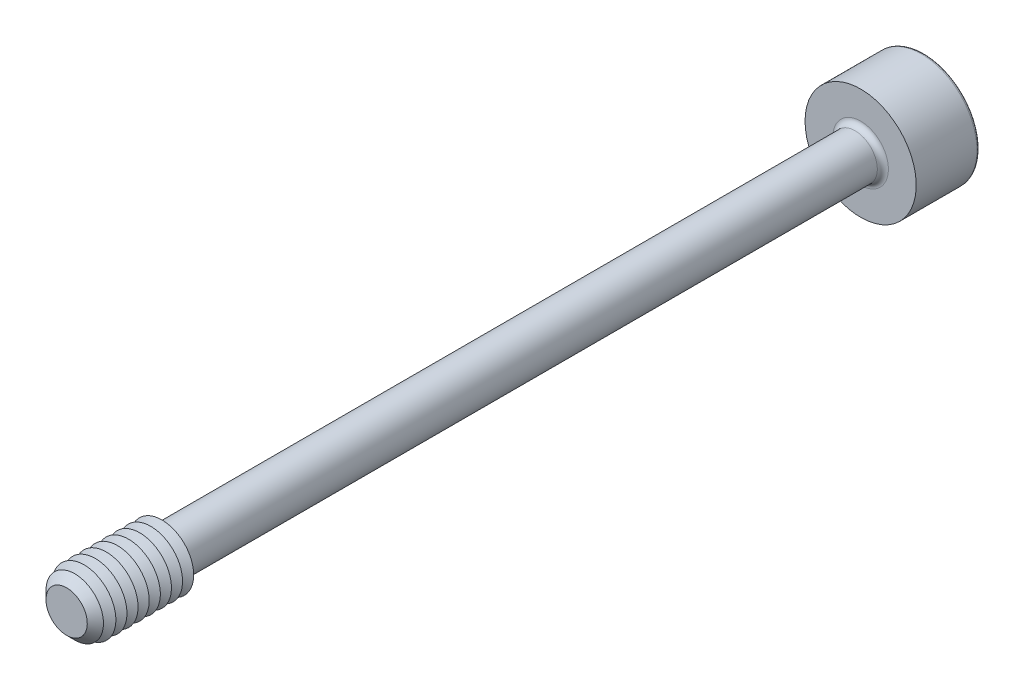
ISO-10303-21;
HEADER;
FILE_DESCRIPTION(('STEP AP214'),'2;1');
FILE_NAME('part.step','',(''),(''),'','','');
FILE_SCHEMA(('AUTOMOTIVE_DESIGN { 1 0 10303 214 1 1 1 1 }'));
ENDSEC;
DATA;
#1=APPLICATION_CONTEXT('core data for automotive mechanical design processes');
#2=APPLICATION_PROTOCOL_DEFINITION('international standard','automotive_design',2000,#1);
#3=PRODUCT_CONTEXT('',#1,'mechanical');
#4=PRODUCT('Part','Part','',(#3));
#5=PRODUCT_RELATED_PRODUCT_CATEGORY('part','',(#4));
#6=PRODUCT_DEFINITION_FORMATION('','',#4);
#7=PRODUCT_DEFINITION_CONTEXT('part definition',#1,'design');
#8=PRODUCT_DEFINITION('design','',#6,#7);
#9=PRODUCT_DEFINITION_SHAPE('','',#8);
#10=(LENGTH_UNIT() NAMED_UNIT(*) SI_UNIT(.MILLI.,.METRE.));
#11=(NAMED_UNIT(*) PLANE_ANGLE_UNIT() SI_UNIT($,.RADIAN.));
#12=(NAMED_UNIT(*) SI_UNIT($,.STERADIAN.) SOLID_ANGLE_UNIT());
#13=UNCERTAINTY_MEASURE_WITH_UNIT(LENGTH_MEASURE(1.E-05),#10,'distance_accuracy_value','');
#14=(GEOMETRIC_REPRESENTATION_CONTEXT(3) GLOBAL_UNCERTAINTY_ASSIGNED_CONTEXT((#13)) GLOBAL_UNIT_ASSIGNED_CONTEXT((#10,
#11,#12)) REPRESENTATION_CONTEXT('',''));
#15=CARTESIAN_POINT('',(0.,0.,0.));
#16=DIRECTION('',(0.,0.,1.));
#17=DIRECTION('',(1.,0.,0.));
#18=AXIS2_PLACEMENT_3D('',#15,#16,#17);
#19=CARTESIAN_POINT('',(-0.866025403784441,-1.5,-26.));
#20=DIRECTION('',(0.,0.,1.));
#21=DIRECTION('',(1.,0.,0.));
#22=AXIS2_PLACEMENT_3D('',#19,#20,#21);
#23=PLANE('',#22);
#24=DIRECTION('',(1.,0.,0.));
#25=VECTOR('',#24,1.);
#26=CARTESIAN_POINT('',(-0.866025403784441,-1.5,-26.));
#27=LINE('',#26,#25);
#28=CARTESIAN_POINT('',(0.,-1.5,-26.));
#29=VERTEX_POINT('',#28);
#30=CARTESIAN_POINT('',(0.866025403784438,-1.5,-26.));
#31=VERTEX_POINT('',#30);
#32=EDGE_CURVE('E761',#29,#31,#27,.T.);
#33=ORIENTED_EDGE('',*,*,#32,.F.);
#34=CARTESIAN_POINT('',(0.,0.,-26.));
#35=DIRECTION('',(0.,0.,1.));
#36=DIRECTION('',(0.,-1.,0.));
#37=AXIS2_PLACEMENT_3D('',#34,#35,#36);
#38=CIRCLE('',#37,1.5);
#39=CARTESIAN_POINT('',(1.29903810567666,-0.75,-26.));
#40=VERTEX_POINT('',#39);
#41=EDGE_CURVE('E53',#29,#40,#38,.T.);
#42=ORIENTED_EDGE('',*,*,#41,.T.);
#43=DIRECTION('',(0.5,0.866025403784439,0.));
#44=VECTOR('',#43,1.);
#45=CARTESIAN_POINT('',(0.866025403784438,-1.5,-26.));
#46=LINE('',#45,#44);
#47=EDGE_CURVE('E746',#31,#40,#46,.T.);
#48=ORIENTED_EDGE('',*,*,#47,.F.);
#49=EDGE_LOOP('',(#33,#42,#48));
#50=FACE_BOUND('',#49,.T.);
#51=ADVANCED_FACE('F41',(#50),#23,.F.);
#52=CARTESIAN_POINT('',(1.73205080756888,0.,-26.));
#53=VERTEX_POINT('',#52);
#54=EDGE_CURVE('E757',#40,#53,#46,.T.);
#55=ORIENTED_EDGE('',*,*,#54,.F.);
#56=CARTESIAN_POINT('',(1.29903810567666,0.749999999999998,-26.));
#57=VERTEX_POINT('',#56);
#58=EDGE_CURVE('E11',#40,#57,#38,.T.);
#59=ORIENTED_EDGE('',*,*,#58,.T.);
#60=DIRECTION('',(-0.5,0.866025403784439,0.));
#61=VECTOR('',#60,1.);
#62=CARTESIAN_POINT('',(1.73205080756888,0.,-26.));
#63=LINE('',#62,#61);
#64=EDGE_CURVE('E745',#53,#57,#63,.T.);
#65=ORIENTED_EDGE('',*,*,#64,.F.);
#66=EDGE_LOOP('',(#55,#59,#65));
#67=FACE_BOUND('',#66,.T.);
#68=ADVANCED_FACE('F133',(#67),#23,.F.);
#69=CARTESIAN_POINT('',(0.866025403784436,1.5,-26.));
#70=VERTEX_POINT('',#69);
#71=EDGE_CURVE('E740',#57,#70,#63,.T.);
#72=ORIENTED_EDGE('',*,*,#71,.F.);
#73=CARTESIAN_POINT('',(0.,1.5,-26.));
#74=VERTEX_POINT('',#73);
#75=EDGE_CURVE('E51',#57,#74,#38,.T.);
#76=ORIENTED_EDGE('',*,*,#75,.T.);
#77=DIRECTION('',(-1.,0.,0.));
#78=VECTOR('',#77,1.);
#79=CARTESIAN_POINT('',(0.866025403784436,1.5,-26.));
#80=LINE('',#79,#78);
#81=EDGE_CURVE('E177',#70,#74,#80,.T.);
#82=ORIENTED_EDGE('',*,*,#81,.F.);
#83=EDGE_LOOP('',(#72,#76,#82));
#84=FACE_BOUND('',#83,.T.);
#85=ADVANCED_FACE('F139',(#84),#23,.F.);
#86=CARTESIAN_POINT('',(-0.866025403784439,1.5,-26.));
#87=VERTEX_POINT('',#86);
#88=EDGE_CURVE('E751',#74,#87,#80,.T.);
#89=ORIENTED_EDGE('',*,*,#88,.F.);
#90=CARTESIAN_POINT('',(-1.29903810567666,0.749999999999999,-26.));
#91=VERTEX_POINT('',#90);
#92=EDGE_CURVE('E265',#74,#91,#38,.T.);
#93=ORIENTED_EDGE('',*,*,#92,.T.);
#94=DIRECTION('',(-0.5,-0.866025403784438,0.));
#95=VECTOR('',#94,1.);
#96=CARTESIAN_POINT('',(-0.866025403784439,1.5,-26.));
#97=LINE('',#96,#95);
#98=EDGE_CURVE('E176',#87,#91,#97,.T.);
#99=ORIENTED_EDGE('',*,*,#98,.F.);
#100=EDGE_LOOP('',(#89,#93,#99));
#101=FACE_BOUND('',#100,.T.);
#102=ADVANCED_FACE('F157',(#101),#23,.F.);
#103=CARTESIAN_POINT('',(-1.73205080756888,0.,-26.));
#104=VERTEX_POINT('',#103);
#105=EDGE_CURVE('E170',#91,#104,#97,.T.);
#106=ORIENTED_EDGE('',*,*,#105,.F.);
#107=CARTESIAN_POINT('',(-1.29903810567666,-0.749999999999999,-26.));
#108=VERTEX_POINT('',#107);
#109=EDGE_CURVE('E172',#91,#108,#38,.T.);
#110=ORIENTED_EDGE('',*,*,#109,.T.);
#111=DIRECTION('',(0.5,-0.866025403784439,0.));
#112=VECTOR('',#111,1.);
#113=CARTESIAN_POINT('',(-1.73205080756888,0.,-26.));
#114=LINE('',#113,#112);
#115=EDGE_CURVE('E174',#104,#108,#114,.T.);
#116=ORIENTED_EDGE('',*,*,#115,.F.);
#117=EDGE_LOOP('',(#106,#110,#116));
#118=FACE_BOUND('',#117,.T.);
#119=ADVANCED_FACE('F146',(#118),#23,.F.);
#120=CARTESIAN_POINT('',(0.,0.,-29.));
#121=DIRECTION('',(0.,0.,-1.));
#122=DIRECTION('',(-1.,0.,0.));
#123=AXIS2_PLACEMENT_3D('',#120,#121,#122);
#124=PLANE('',#123);
#125=CARTESIAN_POINT('',(0.,0.,-29.));
#126=DIRECTION('',(0.,0.,-1.));
#127=DIRECTION('',(-1.,0.,0.));
#128=AXIS2_PLACEMENT_3D('',#125,#126,#127);
#129=CIRCLE('',#128,3.325);
#130=CARTESIAN_POINT('',(-3.325,0.,-29.));
#131=VERTEX_POINT('',#130);
#132=EDGE_CURVE('E251',#131,#131,#129,.T.);
#133=ORIENTED_EDGE('',*,*,#132,.T.);
#134=EDGE_LOOP('',(#133));
#135=FACE_BOUND('',#134,.T.);
#136=DIRECTION('',(-0.5,-0.866025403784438,0.));
#137=VECTOR('',#136,1.);
#138=CARTESIAN_POINT('',(-0.866025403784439,1.5,-29.));
#139=LINE('',#138,#137);
#140=CARTESIAN_POINT('',(-0.866025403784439,1.5,-29.));
#141=VERTEX_POINT('',#140);
#142=CARTESIAN_POINT('',(-1.73205080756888,0.,-29.));
#143=VERTEX_POINT('',#142);
#144=EDGE_CURVE('E212',#141,#143,#139,.T.);
#145=ORIENTED_EDGE('',*,*,#144,.T.);
#146=DIRECTION('',(0.5,-0.866025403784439,0.));
#147=VECTOR('',#146,1.);
#148=CARTESIAN_POINT('',(-1.73205080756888,0.,-29.));
#149=LINE('',#148,#147);
#150=CARTESIAN_POINT('',(-0.866025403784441,-1.5,-29.));
#151=VERTEX_POINT('',#150);
#152=EDGE_CURVE('E67',#143,#151,#149,.T.);
#153=ORIENTED_EDGE('',*,*,#152,.T.);
#154=DIRECTION('',(1.,0.,0.));
#155=VECTOR('',#154,1.);
#156=CARTESIAN_POINT('',(-0.866025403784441,-1.5,-29.));
#157=LINE('',#156,#155);
#158=CARTESIAN_POINT('',(0.866025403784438,-1.5,-29.));
#159=VERTEX_POINT('',#158);
#160=EDGE_CURVE('E196',#151,#159,#157,.T.);
#161=ORIENTED_EDGE('',*,*,#160,.T.);
#162=DIRECTION('',(0.5,0.866025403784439,0.));
#163=VECTOR('',#162,1.);
#164=CARTESIAN_POINT('',(0.866025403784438,-1.5,-29.));
#165=LINE('',#164,#163);
#166=CARTESIAN_POINT('',(1.73205080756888,0.,-29.));
#167=VERTEX_POINT('',#166);
#168=EDGE_CURVE('E200',#159,#167,#165,.T.);
#169=ORIENTED_EDGE('',*,*,#168,.T.);
#170=DIRECTION('',(-0.5,0.866025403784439,0.));
#171=VECTOR('',#170,1.);
#172=CARTESIAN_POINT('',(1.73205080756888,0.,-29.));
#173=LINE('',#172,#171);
#174=CARTESIAN_POINT('',(0.866025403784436,1.5,-29.));
#175=VERTEX_POINT('',#174);
#176=EDGE_CURVE('E204',#167,#175,#173,.T.);
#177=ORIENTED_EDGE('',*,*,#176,.T.);
#178=DIRECTION('',(-1.,0.,0.));
#179=VECTOR('',#178,1.);
#180=CARTESIAN_POINT('',(0.866025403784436,1.5,-29.));
#181=LINE('',#180,#179);
#182=EDGE_CURVE('E208',#175,#141,#181,.T.);
#183=ORIENTED_EDGE('',*,*,#182,.T.);
#184=EDGE_LOOP('',(#145,#153,#161,#169,#177,#183));
#185=FACE_BOUND('',#184,.T.);
#186=ADVANCED_FACE('F156',(#135,#185),#124,.T.);
#187=CARTESIAN_POINT('',(0.,0.,25.));
#188=DIRECTION('',(0.,0.,-1.));
#189=DIRECTION('',(-1.,0.,0.));
#190=AXIS2_PLACEMENT_3D('',#187,#188,#189);
#191=CYLINDRICAL_SURFACE('',#190,1.4);
#192=CARTESIAN_POINT('',(0.,0.,-24.65));
#193=DIRECTION('',(0.,0.,-1.));
#194=DIRECTION('',(-1.,0.,0.));
#195=AXIS2_PLACEMENT_3D('',#192,#193,#194);
#196=CIRCLE('',#195,1.4);
#197=CARTESIAN_POINT('',(-1.4,0.,-24.65));
#198=VERTEX_POINT('',#197);
#199=EDGE_CURVE('E247',#198,#198,#196,.F.);
#200=ORIENTED_EDGE('',*,*,#199,.T.);
#201=EDGE_LOOP('',(#200));
#202=FACE_BOUND('',#201,.T.);
#203=CARTESIAN_POINT('',(0.,0.,18.6535898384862));
#204=DIRECTION('',(0.,0.,-1.));
#205=DIRECTION('',(0.,1.,0.));
#206=AXIS2_PLACEMENT_3D('',#203,#204,#205);
#207=CIRCLE('',#206,1.4);
#208=CARTESIAN_POINT('',(0.,1.4,18.6535898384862));
#209=VERTEX_POINT('',#208);
#210=EDGE_CURVE('E235',#209,#209,#207,.T.);
#211=ORIENTED_EDGE('',*,*,#210,.T.);
#212=EDGE_LOOP('',(#211));
#213=FACE_BOUND('',#212,.T.);
#214=ADVANCED_FACE('F163',(#202,#213),#191,.T.);
#215=CARTESIAN_POINT('',(0.,0.,18.6535898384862));
#216=DIRECTION('',(0.,0.,1.));
#217=DIRECTION('',(0.,-1.,0.));
#218=AXIS2_PLACEMENT_3D('',#215,#216,#217);
#219=CONICAL_SURFACE('',#218,1.4,1.04719755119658);
#220=CARTESIAN_POINT('',(0.,0.,19.));
#221=DIRECTION('',(0.,0.,-1.));
#222=DIRECTION('',(-1.,0.,0.));
#223=AXIS2_PLACEMENT_3D('',#220,#221,#222);
#224=CIRCLE('',#223,2.);
#225=CARTESIAN_POINT('',(-2.,0.,19.));
#226=VERTEX_POINT('',#225);
#227=EDGE_CURVE('E269',#226,#226,#224,.T.);
#228=ORIENTED_EDGE('',*,*,#227,.T.);
#229=EDGE_LOOP('',(#228));
#230=FACE_BOUND('',#229,.T.);
#231=ORIENTED_EDGE('',*,*,#210,.F.);
#232=EDGE_LOOP('',(#231));
#233=FACE_BOUND('',#232,.T.);
#234=ADVANCED_FACE('F509',(#230,#233),#219,.T.);
#235=CARTESIAN_POINT('',(0.,0.,-25.));
#236=DIRECTION('',(0.,0.,-1.));
#237=DIRECTION('',(-1.,0.,0.));
#238=AXIS2_PLACEMENT_3D('',#235,#236,#237);
#239=PLANE('',#238);
#240=CARTESIAN_POINT('',(0.,0.,-25.));
#241=DIRECTION('',(0.,0.,-1.));
#242=DIRECTION('',(-1.,0.,0.));
#243=AXIS2_PLACEMENT_3D('',#240,#241,#242);
#244=CIRCLE('',#243,1.75);
#245=CARTESIAN_POINT('',(-1.75,0.,-25.));
#246=VERTEX_POINT('',#245);
#247=EDGE_CURVE('E243',#246,#246,#244,.T.);
#248=ORIENTED_EDGE('',*,*,#247,.T.);
#249=EDGE_LOOP('',(#248));
#250=FACE_BOUND('',#249,.T.);
#251=CARTESIAN_POINT('',(0.,0.,-25.));
#252=DIRECTION('',(0.,0.,-1.));
#253=DIRECTION('',(-1.,0.,0.));
#254=AXIS2_PLACEMENT_3D('',#251,#252,#253);
#255=CIRCLE('',#254,3.5);
#256=CARTESIAN_POINT('',(-3.5,0.,-25.));
#257=VERTEX_POINT('',#256);
#258=EDGE_CURVE('E231',#257,#257,#255,.T.);
#259=ORIENTED_EDGE('',*,*,#258,.F.);
#260=EDGE_LOOP('',(#259));
#261=FACE_BOUND('',#260,.T.);
#262=ADVANCED_FACE('F502',(#250,#261),#239,.F.);
#263=CARTESIAN_POINT('',(0.,0.,-29.));
#264=DIRECTION('',(0.,0.,1.));
#265=DIRECTION('',(1.,0.,0.));
#266=AXIS2_PLACEMENT_3D('',#263,#264,#265);
#267=CYLINDRICAL_SURFACE('',#266,3.5);
#268=CARTESIAN_POINT('',(0.,0.,-28.825));
#269=DIRECTION('',(0.,0.,-1.));
#270=DIRECTION('',(-1.,0.,0.));
#271=AXIS2_PLACEMENT_3D('',#268,#269,#270);
#272=CIRCLE('',#271,3.5);
#273=CARTESIAN_POINT('',(-3.5,0.,-28.825));
#274=VERTEX_POINT('',#273);
#275=EDGE_CURVE('E254',#274,#274,#272,.F.);
#276=ORIENTED_EDGE('',*,*,#275,.T.);
#277=EDGE_LOOP('',(#276));
#278=FACE_BOUND('',#277,.T.);
#279=ORIENTED_EDGE('',*,*,#258,.T.);
#280=EDGE_LOOP('',(#279));
#281=FACE_BOUND('',#280,.T.);
#282=ADVANCED_FACE('F508',(#278,#281),#267,.T.);
#283=CARTESIAN_POINT('',(-1.73205080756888,0.,-26.));
#284=DIRECTION('',(0.866025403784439,0.5,0.));
#285=DIRECTION('',(-0.5,0.866025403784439,0.));
#286=AXIS2_PLACEMENT_3D('',#283,#284,#285);
#287=PLANE('',#286);
#288=ORIENTED_EDGE('',*,*,#152,.F.);
#289=DIRECTION('',(0.,0.,-1.));
#290=VECTOR('',#289,1.);
#291=CARTESIAN_POINT('',(-1.73205080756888,0.,-26.));
#292=LINE('',#291,#290);
#293=EDGE_CURVE('E186',#104,#143,#292,.T.);
#294=ORIENTED_EDGE('',*,*,#293,.F.);
#295=ORIENTED_EDGE('',*,*,#115,.T.);
#296=CARTESIAN_POINT('',(-0.866025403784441,-1.5,-26.));
#297=VERTEX_POINT('',#296);
#298=EDGE_CURVE('E215',#108,#297,#114,.T.);
#299=ORIENTED_EDGE('',*,*,#298,.T.);
#300=DIRECTION('',(0.,0.,-1.));
#301=VECTOR('',#300,1.);
#302=CARTESIAN_POINT('',(-0.866025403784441,-1.5,-26.));
#303=LINE('',#302,#301);
#304=EDGE_CURVE('E228',#297,#151,#303,.T.);
#305=ORIENTED_EDGE('',*,*,#304,.T.);
#306=EDGE_LOOP('',(#288,#294,#295,#299,#305));
#307=FACE_BOUND('',#306,.T.);
#308=ADVANCED_FACE('F520',(#307),#287,.T.);
#309=CARTESIAN_POINT('',(-0.866025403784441,-1.5,-26.));
#310=DIRECTION('',(0.,1.,0.));
#311=DIRECTION('',(0.,0.,1.));
#312=AXIS2_PLACEMENT_3D('',#309,#310,#311);
#313=PLANE('',#312);
#314=ORIENTED_EDGE('',*,*,#160,.F.);
#315=ORIENTED_EDGE('',*,*,#304,.F.);
#316=EDGE_CURVE('E758',#297,#29,#27,.T.);
#317=ORIENTED_EDGE('',*,*,#316,.T.);
#318=ORIENTED_EDGE('',*,*,#32,.T.);
#319=DIRECTION('',(0.,0.,-1.));
#320=VECTOR('',#319,1.);
#321=CARTESIAN_POINT('',(0.866025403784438,-1.5,-26.));
#322=LINE('',#321,#320);
#323=EDGE_CURVE('E225',#31,#159,#322,.T.);
#324=ORIENTED_EDGE('',*,*,#323,.T.);
#325=EDGE_LOOP('',(#314,#315,#317,#318,#324));
#326=FACE_BOUND('',#325,.T.);
#327=ADVANCED_FACE('F536',(#326),#313,.T.);
#328=CARTESIAN_POINT('',(0.866025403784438,-1.5,-26.));
#329=DIRECTION('',(-0.866025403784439,0.5,0.));
#330=DIRECTION('',(-0.5,-0.866025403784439,0.));
#331=AXIS2_PLACEMENT_3D('',#328,#329,#330);
#332=PLANE('',#331);
#333=ORIENTED_EDGE('',*,*,#168,.F.);
#334=ORIENTED_EDGE('',*,*,#323,.F.);
#335=ORIENTED_EDGE('',*,*,#47,.T.);
#336=ORIENTED_EDGE('',*,*,#54,.T.);
#337=DIRECTION('',(0.,0.,-1.));
#338=VECTOR('',#337,1.);
#339=CARTESIAN_POINT('',(1.73205080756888,0.,-26.));
#340=LINE('',#339,#338);
#341=EDGE_CURVE('E222',#53,#167,#340,.T.);
#342=ORIENTED_EDGE('',*,*,#341,.T.);
#343=EDGE_LOOP('',(#333,#334,#335,#336,#342));
#344=FACE_BOUND('',#343,.T.);
#345=ADVANCED_FACE('F546',(#344),#332,.T.);
#346=CARTESIAN_POINT('',(1.73205080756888,0.,-26.));
#347=DIRECTION('',(-0.866025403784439,-0.5,0.));
#348=DIRECTION('',(0.5,-0.866025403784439,0.));
#349=AXIS2_PLACEMENT_3D('',#346,#347,#348);
#350=PLANE('',#349);
#351=ORIENTED_EDGE('',*,*,#176,.F.);
#352=ORIENTED_EDGE('',*,*,#341,.F.);
#353=ORIENTED_EDGE('',*,*,#64,.T.);
#354=ORIENTED_EDGE('',*,*,#71,.T.);
#355=DIRECTION('',(0.,0.,-1.));
#356=VECTOR('',#355,1.);
#357=CARTESIAN_POINT('',(0.866025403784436,1.5,-26.));
#358=LINE('',#357,#356);
#359=EDGE_CURVE('E219',#70,#175,#358,.T.);
#360=ORIENTED_EDGE('',*,*,#359,.T.);
#361=EDGE_LOOP('',(#351,#352,#353,#354,#360));
#362=FACE_BOUND('',#361,.T.);
#363=ADVANCED_FACE('F556',(#362),#350,.T.);
#364=CARTESIAN_POINT('',(0.866025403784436,1.5,-26.));
#365=DIRECTION('',(0.,-1.,0.));
#366=DIRECTION('',(0.,0.,-1.));
#367=AXIS2_PLACEMENT_3D('',#364,#365,#366);
#368=PLANE('',#367);
#369=ORIENTED_EDGE('',*,*,#182,.F.);
#370=ORIENTED_EDGE('',*,*,#359,.F.);
#371=ORIENTED_EDGE('',*,*,#81,.T.);
#372=ORIENTED_EDGE('',*,*,#88,.T.);
#373=DIRECTION('',(0.,0.,-1.));
#374=VECTOR('',#373,1.);
#375=CARTESIAN_POINT('',(-0.866025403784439,1.5,-26.));
#376=LINE('',#375,#374);
#377=EDGE_CURVE('E182',#87,#141,#376,.T.);
#378=ORIENTED_EDGE('',*,*,#377,.T.);
#379=EDGE_LOOP('',(#369,#370,#371,#372,#378));
#380=FACE_BOUND('',#379,.T.);
#381=ADVANCED_FACE('F152',(#380),#368,.T.);
#382=CARTESIAN_POINT('',(-0.866025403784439,1.5,-26.));
#383=DIRECTION('',(0.866025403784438,-0.5,0.));
#384=DIRECTION('',(0.5,0.866025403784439,0.));
#385=AXIS2_PLACEMENT_3D('',#382,#383,#384);
#386=PLANE('',#385);
#387=ORIENTED_EDGE('',*,*,#144,.F.);
#388=ORIENTED_EDGE('',*,*,#377,.F.);
#389=ORIENTED_EDGE('',*,*,#98,.T.);
#390=ORIENTED_EDGE('',*,*,#105,.T.);
#391=ORIENTED_EDGE('',*,*,#293,.T.);
#392=EDGE_LOOP('',(#387,#388,#389,#390,#391));
#393=FACE_BOUND('',#392,.T.);
#394=ADVANCED_FACE('F144',(#393),#386,.T.);
#395=ORIENTED_EDGE('',*,*,#298,.F.);
#396=EDGE_CURVE('E257',#108,#29,#38,.T.);
#397=ORIENTED_EDGE('',*,*,#396,.T.);
#398=ORIENTED_EDGE('',*,*,#316,.F.);
#399=EDGE_LOOP('',(#395,#397,#398));
#400=FACE_BOUND('',#399,.T.);
#401=ADVANCED_FACE('F135',(#400),#23,.F.);
#402=CARTESIAN_POINT('',(0.,0.,-24.65));
#403=DIRECTION('',(0.,0.,-1.));
#404=DIRECTION('',(-1.,0.,0.));
#405=AXIS2_PLACEMENT_3D('',#402,#403,#404);
#406=TOROIDAL_SURFACE('',#405,1.75,0.35);
#407=ORIENTED_EDGE('',*,*,#199,.F.);
#408=EDGE_LOOP('',(#407));
#409=FACE_BOUND('',#408,.T.);
#410=ORIENTED_EDGE('',*,*,#247,.F.);
#411=EDGE_LOOP('',(#410));
#412=FACE_BOUND('',#411,.T.);
#413=ADVANCED_FACE('F129',(#409,#412),#406,.F.);
#414=CARTESIAN_POINT('',(0.,0.,-28.825));
#415=DIRECTION('',(0.,0.,-1.));
#416=DIRECTION('',(-1.,0.,0.));
#417=AXIS2_PLACEMENT_3D('',#414,#415,#416);
#418=TOROIDAL_SURFACE('',#417,3.325,0.175);
#419=ORIENTED_EDGE('',*,*,#275,.F.);
#420=EDGE_LOOP('',(#419));
#421=FACE_BOUND('',#420,.T.);
#422=ORIENTED_EDGE('',*,*,#132,.F.);
#423=EDGE_LOOP('',(#422));
#424=FACE_BOUND('',#423,.T.);
#425=ADVANCED_FACE('F43',(#421,#424),#418,.T.);
#426=CARTESIAN_POINT('',(0.,0.,-25.1339745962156));
#427=DIRECTION('',(0.,0.,-1.));
#428=DIRECTION('',(0.,1.,0.));
#429=AXIS2_PLACEMENT_3D('',#426,#427,#428);
#430=CONICAL_SURFACE('',#429,0.,1.0471975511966);
#431=ORIENTED_EDGE('',*,*,#41,.F.);
#432=ORIENTED_EDGE('',*,*,#396,.F.);
#433=ORIENTED_EDGE('',*,*,#109,.F.);
#434=ORIENTED_EDGE('',*,*,#92,.F.);
#435=ORIENTED_EDGE('',*,*,#75,.F.);
#436=ORIENTED_EDGE('',*,*,#58,.F.);
#437=EDGE_LOOP('',(#431,#432,#433,#434,#435,#436));
#438=FACE_BOUND('',#437,.T.);
#439=CARTESIAN_POINT('',(0.,0.,-25.1339745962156));
#440=VERTEX_POINT('',#439);
#441=VERTEX_LOOP('',#440);
#442=FACE_BOUND('',#441,.T.);
#443=ADVANCED_FACE('F118',(#438,#442),#430,.F.);
#444=CARTESIAN_POINT('',(0.,0.,19.35));
#445=DIRECTION('',(0.,0.,-1.));
#446=DIRECTION('',(-1.,0.,0.));
#447=AXIS2_PLACEMENT_3D('',#444,#445,#446);
#448=CONICAL_SURFACE('',#447,1.39378221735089,1.0471975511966);
#449=ORIENTED_EDGE('',*,*,#227,.F.);
#450=EDGE_LOOP('',(#449));
#451=FACE_BOUND('',#450,.T.);
#452=CARTESIAN_POINT('',(0.,0.,19.35));
#453=DIRECTION('',(0.,0.,-1.));
#454=DIRECTION('',(-1.,0.,0.));
#455=AXIS2_PLACEMENT_3D('',#452,#453,#454);
#456=CIRCLE('',#455,1.39378221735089);
#457=CARTESIAN_POINT('',(-1.39378221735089,0.,19.35));
#458=VERTEX_POINT('',#457);
#459=EDGE_CURVE('E275',#458,#458,#456,.T.);
#460=ORIENTED_EDGE('',*,*,#459,.T.);
#461=EDGE_LOOP('',(#460));
#462=FACE_BOUND('',#461,.T.);
#463=ADVANCED_FACE('F120',(#451,#462),#448,.T.);
#464=CARTESIAN_POINT('',(0.,0.,19.7));
#465=DIRECTION('',(0.,0.,1.));
#466=DIRECTION('',(1.,0.,0.));
#467=AXIS2_PLACEMENT_3D('',#464,#465,#466);
#468=CONICAL_SURFACE('',#467,2.,1.0471975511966);
#469=ORIENTED_EDGE('',*,*,#459,.F.);
#470=EDGE_LOOP('',(#469));
#471=FACE_BOUND('',#470,.T.);
#472=CARTESIAN_POINT('',(0.,0.,19.7));
#473=DIRECTION('',(0.,0.,-1.));
#474=DIRECTION('',(-1.,0.,0.));
#475=AXIS2_PLACEMENT_3D('',#472,#473,#474);
#476=CIRCLE('',#475,2.);
#477=CARTESIAN_POINT('',(-2.,0.,19.7));
#478=VERTEX_POINT('',#477);
#479=EDGE_CURVE('E280',#478,#478,#476,.T.);
#480=ORIENTED_EDGE('',*,*,#479,.T.);
#481=EDGE_LOOP('',(#480));
#482=FACE_BOUND('',#481,.T.);
#483=ADVANCED_FACE('F126',(#471,#482),#468,.T.);
#484=CARTESIAN_POINT('',(0.,0.,20.05));
#485=DIRECTION('',(0.,0.,-1.));
#486=DIRECTION('',(-1.,0.,0.));
#487=AXIS2_PLACEMENT_3D('',#484,#485,#486);
#488=CONICAL_SURFACE('',#487,1.39378221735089,1.0471975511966);
#489=ORIENTED_EDGE('',*,*,#479,.F.);
#490=EDGE_LOOP('',(#489));
#491=FACE_BOUND('',#490,.T.);
#492=CARTESIAN_POINT('',(0.,0.,20.05));
#493=DIRECTION('',(0.,0.,-1.));
#494=DIRECTION('',(-1.,0.,0.));
#495=AXIS2_PLACEMENT_3D('',#492,#493,#494);
#496=CIRCLE('',#495,1.39378221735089);
#497=CARTESIAN_POINT('',(-1.39378221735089,0.,20.05));
#498=VERTEX_POINT('',#497);
#499=EDGE_CURVE('E285',#498,#498,#496,.T.);
#500=ORIENTED_EDGE('',*,*,#499,.T.);
#501=EDGE_LOOP('',(#500));
#502=FACE_BOUND('',#501,.T.);
#503=ADVANCED_FACE('F396',(#491,#502),#488,.T.);
#504=CARTESIAN_POINT('',(0.,0.,20.4));
#505=DIRECTION('',(0.,0.,1.));
#506=DIRECTION('',(1.,0.,0.));
#507=AXIS2_PLACEMENT_3D('',#504,#505,#506);
#508=CONICAL_SURFACE('',#507,2.,1.0471975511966);
#509=ORIENTED_EDGE('',*,*,#499,.F.);
#510=EDGE_LOOP('',(#509));
#511=FACE_BOUND('',#510,.T.);
#512=CARTESIAN_POINT('',(0.,0.,20.4));
#513=DIRECTION('',(0.,0.,-1.));
#514=DIRECTION('',(-1.,0.,0.));
#515=AXIS2_PLACEMENT_3D('',#512,#513,#514);
#516=CIRCLE('',#515,2.);
#517=CARTESIAN_POINT('',(-2.,0.,20.4));
#518=VERTEX_POINT('',#517);
#519=EDGE_CURVE('E288',#518,#518,#516,.T.);
#520=ORIENTED_EDGE('',*,*,#519,.T.);
#521=EDGE_LOOP('',(#520));
#522=FACE_BOUND('',#521,.T.);
#523=ADVANCED_FACE('F392',(#511,#522),#508,.T.);
#524=CARTESIAN_POINT('',(0.,0.,20.75));
#525=DIRECTION('',(0.,0.,-1.));
#526=DIRECTION('',(-1.,0.,0.));
#527=AXIS2_PLACEMENT_3D('',#524,#525,#526);
#528=CONICAL_SURFACE('',#527,1.39378221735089,1.0471975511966);
#529=ORIENTED_EDGE('',*,*,#519,.F.);
#530=EDGE_LOOP('',(#529));
#531=FACE_BOUND('',#530,.T.);
#532=CARTESIAN_POINT('',(0.,0.,20.75));
#533=DIRECTION('',(0.,0.,-1.));
#534=DIRECTION('',(-1.,0.,0.));
#535=AXIS2_PLACEMENT_3D('',#532,#533,#534);
#536=CIRCLE('',#535,1.39378221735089);
#537=CARTESIAN_POINT('',(-1.39378221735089,0.,20.75));
#538=VERTEX_POINT('',#537);
#539=EDGE_CURVE('E292',#538,#538,#536,.T.);
#540=ORIENTED_EDGE('',*,*,#539,.T.);
#541=EDGE_LOOP('',(#540));
#542=FACE_BOUND('',#541,.T.);
#543=ADVANCED_FACE('F388',(#531,#542),#528,.T.);
#544=CARTESIAN_POINT('',(0.,0.,21.1));
#545=DIRECTION('',(0.,0.,1.));
#546=DIRECTION('',(1.,0.,0.));
#547=AXIS2_PLACEMENT_3D('',#544,#545,#546);
#548=CONICAL_SURFACE('',#547,2.,1.0471975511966);
#549=ORIENTED_EDGE('',*,*,#539,.F.);
#550=EDGE_LOOP('',(#549));
#551=FACE_BOUND('',#550,.T.);
#552=CARTESIAN_POINT('',(0.,0.,21.1));
#553=DIRECTION('',(0.,0.,-1.));
#554=DIRECTION('',(-1.,0.,0.));
#555=AXIS2_PLACEMENT_3D('',#552,#553,#554);
#556=CIRCLE('',#555,2.);
#557=CARTESIAN_POINT('',(-2.,0.,21.1));
#558=VERTEX_POINT('',#557);
#559=EDGE_CURVE('E296',#558,#558,#556,.T.);
#560=ORIENTED_EDGE('',*,*,#559,.T.);
#561=EDGE_LOOP('',(#560));
#562=FACE_BOUND('',#561,.T.);
#563=ADVANCED_FACE('F384',(#551,#562),#548,.T.);
#564=CARTESIAN_POINT('',(0.,0.,21.45));
#565=DIRECTION('',(0.,0.,-1.));
#566=DIRECTION('',(-1.,0.,0.));
#567=AXIS2_PLACEMENT_3D('',#564,#565,#566);
#568=CONICAL_SURFACE('',#567,1.39378221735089,1.0471975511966);
#569=ORIENTED_EDGE('',*,*,#559,.F.);
#570=EDGE_LOOP('',(#569));
#571=FACE_BOUND('',#570,.T.);
#572=CARTESIAN_POINT('',(0.,0.,21.45));
#573=DIRECTION('',(0.,0.,-1.));
#574=DIRECTION('',(-1.,0.,0.));
#575=AXIS2_PLACEMENT_3D('',#572,#573,#574);
#576=CIRCLE('',#575,1.39378221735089);
#577=CARTESIAN_POINT('',(-1.39378221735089,0.,21.45));
#578=VERTEX_POINT('',#577);
#579=EDGE_CURVE('E300',#578,#578,#576,.T.);
#580=ORIENTED_EDGE('',*,*,#579,.T.);
#581=EDGE_LOOP('',(#580));
#582=FACE_BOUND('',#581,.T.);
#583=ADVANCED_FACE('F380',(#571,#582),#568,.T.);
#584=CARTESIAN_POINT('',(0.,0.,21.8));
#585=DIRECTION('',(0.,0.,1.));
#586=DIRECTION('',(1.,0.,0.));
#587=AXIS2_PLACEMENT_3D('',#584,#585,#586);
#588=CONICAL_SURFACE('',#587,2.,1.0471975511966);
#589=ORIENTED_EDGE('',*,*,#579,.F.);
#590=EDGE_LOOP('',(#589));
#591=FACE_BOUND('',#590,.T.);
#592=CARTESIAN_POINT('',(0.,0.,21.8));
#593=DIRECTION('',(0.,0.,-1.));
#594=DIRECTION('',(-1.,0.,0.));
#595=AXIS2_PLACEMENT_3D('',#592,#593,#594);
#596=CIRCLE('',#595,2.);
#597=CARTESIAN_POINT('',(-2.,0.,21.8));
#598=VERTEX_POINT('',#597);
#599=EDGE_CURVE('E304',#598,#598,#596,.T.);
#600=ORIENTED_EDGE('',*,*,#599,.T.);
#601=EDGE_LOOP('',(#600));
#602=FACE_BOUND('',#601,.T.);
#603=ADVANCED_FACE('F376',(#591,#602),#588,.T.);
#604=CARTESIAN_POINT('',(0.,0.,22.15));
#605=DIRECTION('',(0.,0.,-1.));
#606=DIRECTION('',(-1.,0.,0.));
#607=AXIS2_PLACEMENT_3D('',#604,#605,#606);
#608=CONICAL_SURFACE('',#607,1.39378221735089,1.0471975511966);
#609=ORIENTED_EDGE('',*,*,#599,.F.);
#610=EDGE_LOOP('',(#609));
#611=FACE_BOUND('',#610,.T.);
#612=CARTESIAN_POINT('',(0.,0.,22.15));
#613=DIRECTION('',(0.,0.,-1.));
#614=DIRECTION('',(-1.,0.,0.));
#615=AXIS2_PLACEMENT_3D('',#612,#613,#614);
#616=CIRCLE('',#615,1.39378221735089);
#617=CARTESIAN_POINT('',(-1.39378221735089,0.,22.15));
#618=VERTEX_POINT('',#617);
#619=EDGE_CURVE('E308',#618,#618,#616,.T.);
#620=ORIENTED_EDGE('',*,*,#619,.T.);
#621=EDGE_LOOP('',(#620));
#622=FACE_BOUND('',#621,.T.);
#623=ADVANCED_FACE('F372',(#611,#622),#608,.T.);
#624=CARTESIAN_POINT('',(0.,0.,22.5));
#625=DIRECTION('',(0.,0.,1.));
#626=DIRECTION('',(1.,0.,0.));
#627=AXIS2_PLACEMENT_3D('',#624,#625,#626);
#628=CONICAL_SURFACE('',#627,2.,1.0471975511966);
#629=ORIENTED_EDGE('',*,*,#619,.F.);
#630=EDGE_LOOP('',(#629));
#631=FACE_BOUND('',#630,.T.);
#632=CARTESIAN_POINT('',(0.,0.,22.5));
#633=DIRECTION('',(0.,0.,-1.));
#634=DIRECTION('',(-1.,0.,0.));
#635=AXIS2_PLACEMENT_3D('',#632,#633,#634);
#636=CIRCLE('',#635,2.);
#637=CARTESIAN_POINT('',(-2.,0.,22.5));
#638=VERTEX_POINT('',#637);
#639=EDGE_CURVE('E312',#638,#638,#636,.T.);
#640=ORIENTED_EDGE('',*,*,#639,.T.);
#641=EDGE_LOOP('',(#640));
#642=FACE_BOUND('',#641,.T.);
#643=ADVANCED_FACE('F368',(#631,#642),#628,.T.);
#644=CARTESIAN_POINT('',(0.,0.,22.85));
#645=DIRECTION('',(0.,0.,-1.));
#646=DIRECTION('',(-1.,0.,0.));
#647=AXIS2_PLACEMENT_3D('',#644,#645,#646);
#648=CONICAL_SURFACE('',#647,1.39378221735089,1.0471975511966);
#649=ORIENTED_EDGE('',*,*,#639,.F.);
#650=EDGE_LOOP('',(#649));
#651=FACE_BOUND('',#650,.T.);
#652=CARTESIAN_POINT('',(0.,0.,22.85));
#653=DIRECTION('',(0.,0.,-1.));
#654=DIRECTION('',(-1.,0.,0.));
#655=AXIS2_PLACEMENT_3D('',#652,#653,#654);
#656=CIRCLE('',#655,1.39378221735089);
#657=CARTESIAN_POINT('',(-1.39378221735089,0.,22.85));
#658=VERTEX_POINT('',#657);
#659=EDGE_CURVE('E315',#658,#658,#656,.T.);
#660=ORIENTED_EDGE('',*,*,#659,.T.);
#661=EDGE_LOOP('',(#660));
#662=FACE_BOUND('',#661,.T.);
#663=ADVANCED_FACE('F364',(#651,#662),#648,.T.);
#664=CARTESIAN_POINT('',(0.,0.,23.2));
#665=DIRECTION('',(0.,0.,1.));
#666=DIRECTION('',(1.,0.,0.));
#667=AXIS2_PLACEMENT_3D('',#664,#665,#666);
#668=CONICAL_SURFACE('',#667,2.,1.0471975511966);
#669=ORIENTED_EDGE('',*,*,#659,.F.);
#670=EDGE_LOOP('',(#669));
#671=FACE_BOUND('',#670,.T.);
#672=CARTESIAN_POINT('',(0.,0.,23.2));
#673=DIRECTION('',(0.,0.,-1.));
#674=DIRECTION('',(-1.,0.,0.));
#675=AXIS2_PLACEMENT_3D('',#672,#673,#674);
#676=CIRCLE('',#675,2.);
#677=CARTESIAN_POINT('',(-2.,0.,23.2));
#678=VERTEX_POINT('',#677);
#679=EDGE_CURVE('E319',#678,#678,#676,.T.);
#680=ORIENTED_EDGE('',*,*,#679,.T.);
#681=EDGE_LOOP('',(#680));
#682=FACE_BOUND('',#681,.T.);
#683=ADVANCED_FACE('F360',(#671,#682),#668,.T.);
#684=CARTESIAN_POINT('',(0.,0.,23.55));
#685=DIRECTION('',(0.,0.,-1.));
#686=DIRECTION('',(-1.,0.,0.));
#687=AXIS2_PLACEMENT_3D('',#684,#685,#686);
#688=CONICAL_SURFACE('',#687,1.39378221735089,1.0471975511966);
#689=ORIENTED_EDGE('',*,*,#679,.F.);
#690=EDGE_LOOP('',(#689));
#691=FACE_BOUND('',#690,.T.);
#692=CARTESIAN_POINT('',(0.,0.,23.55));
#693=DIRECTION('',(0.,0.,-1.));
#694=DIRECTION('',(-1.,0.,0.));
#695=AXIS2_PLACEMENT_3D('',#692,#693,#694);
#696=CIRCLE('',#695,1.39378221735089);
#697=CARTESIAN_POINT('',(-1.39378221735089,0.,23.55));
#698=VERTEX_POINT('',#697);
#699=EDGE_CURVE('E323',#698,#698,#696,.T.);
#700=ORIENTED_EDGE('',*,*,#699,.T.);
#701=EDGE_LOOP('',(#700));
#702=FACE_BOUND('',#701,.T.);
#703=ADVANCED_FACE('F356',(#691,#702),#688,.T.);
#704=CARTESIAN_POINT('',(0.,0.,23.9));
#705=DIRECTION('',(0.,0.,1.));
#706=DIRECTION('',(1.,0.,0.));
#707=AXIS2_PLACEMENT_3D('',#704,#705,#706);
#708=CONICAL_SURFACE('',#707,2.,1.0471975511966);
#709=ORIENTED_EDGE('',*,*,#699,.F.);
#710=EDGE_LOOP('',(#709));
#711=FACE_BOUND('',#710,.T.);
#712=CARTESIAN_POINT('',(0.,0.,23.9));
#713=DIRECTION('',(0.,0.,-1.));
#714=DIRECTION('',(-1.,0.,0.));
#715=AXIS2_PLACEMENT_3D('',#712,#713,#714);
#716=CIRCLE('',#715,2.);
#717=CARTESIAN_POINT('',(-2.,0.,23.9));
#718=VERTEX_POINT('',#717);
#719=EDGE_CURVE('E327',#718,#718,#716,.T.);
#720=ORIENTED_EDGE('',*,*,#719,.T.);
#721=EDGE_LOOP('',(#720));
#722=FACE_BOUND('',#721,.T.);
#723=ADVANCED_FACE('F349',(#711,#722),#708,.T.);
#724=CARTESIAN_POINT('',(0.,0.,24.25));
#725=DIRECTION('',(0.,0.,-1.));
#726=DIRECTION('',(-1.,0.,0.));
#727=AXIS2_PLACEMENT_3D('',#724,#725,#726);
#728=CONICAL_SURFACE('',#727,1.39378221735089,1.0471975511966);
#729=ORIENTED_EDGE('',*,*,#719,.F.);
#730=EDGE_LOOP('',(#729));
#731=FACE_BOUND('',#730,.T.);
#732=CARTESIAN_POINT('',(0.,0.,24.25));
#733=DIRECTION('',(0.,0.,-1.));
#734=DIRECTION('',(-1.,0.,0.));
#735=AXIS2_PLACEMENT_3D('',#732,#733,#734);
#736=CIRCLE('',#735,1.39378221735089);
#737=CARTESIAN_POINT('',(-1.39378221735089,0.,24.25));
#738=VERTEX_POINT('',#737);
#739=EDGE_CURVE('E331',#738,#738,#736,.T.);
#740=ORIENTED_EDGE('',*,*,#739,.T.);
#741=EDGE_LOOP('',(#740));
#742=FACE_BOUND('',#741,.T.);
#743=ADVANCED_FACE('F335',(#731,#742),#728,.T.);
#744=CARTESIAN_POINT('',(0.,0.,24.6));
#745=DIRECTION('',(0.,0.,1.));
#746=DIRECTION('',(1.,0.,0.));
#747=AXIS2_PLACEMENT_3D('',#744,#745,#746);
#748=CONICAL_SURFACE('',#747,2.,1.0471975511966);
#749=CARTESIAN_POINT('',(0.,0.,24.4901923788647));
#750=DIRECTION('',(0.,0.,1.));
#751=DIRECTION('',(1.,0.,0.));
#752=AXIS2_PLACEMENT_3D('',#749,#750,#751);
#753=CIRCLE('',#752,1.80980762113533);
#754=CARTESIAN_POINT('',(0.,1.80980762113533,24.4901923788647));
#755=VERTEX_POINT('',#754);
#756=EDGE_CURVE('E45',#755,#755,#753,.F.);
#757=ORIENTED_EDGE('',*,*,#756,.T.);
#758=EDGE_LOOP('',(#757));
#759=FACE_BOUND('',#758,.T.);
#760=ORIENTED_EDGE('',*,*,#739,.F.);
#761=EDGE_LOOP('',(#760));
#762=FACE_BOUND('',#761,.T.);
#763=ADVANCED_FACE('F337',(#759,#762),#748,.T.);
#764=CARTESIAN_POINT('',(0.,0.,25.));
#765=DIRECTION('',(0.,0.,1.));
#766=DIRECTION('',(1.,0.,0.));
#767=AXIS2_PLACEMENT_3D('',#764,#765,#766);
#768=PLANE('',#767);
#769=CARTESIAN_POINT('',(0.,0.,25.));
#770=DIRECTION('',(0.,0.,1.));
#771=DIRECTION('',(1.,0.,0.));
#772=AXIS2_PLACEMENT_3D('',#769,#770,#771);
#773=CIRCLE('',#772,1.3);
#774=CARTESIAN_POINT('',(0.,1.3,25.));
#775=VERTEX_POINT('',#774);
#776=EDGE_CURVE('E239',#775,#775,#773,.T.);
#777=ORIENTED_EDGE('',*,*,#776,.T.);
#778=EDGE_LOOP('',(#777));
#779=FACE_BOUND('',#778,.T.);
#780=ADVANCED_FACE('F339',(#779),#768,.T.);
#781=CARTESIAN_POINT('',(0.,0.,24.3));
#782=DIRECTION('',(0.,0.,-1.));
#783=DIRECTION('',(0.,1.,0.));
#784=AXIS2_PLACEMENT_3D('',#781,#782,#783);
#785=CONICAL_SURFACE('',#784,2.,0.785398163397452);
#786=CARTESIAN_POINT('',(0.,1.80980762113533,24.4901923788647));
#787=CARTESIAN_POINT('',(0.,1.80449712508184,24.4955028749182));
#788=CARTESIAN_POINT('',(0.,1.79918662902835,24.5008133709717));
#789=CARTESIAN_POINT('',(0.,1.78856563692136,24.5114343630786));
#790=CARTESIAN_POINT('',(0.,1.78325514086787,24.5167448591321));
#791=CARTESIAN_POINT('',(0.,1.77263414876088,24.5273658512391));
#792=CARTESIAN_POINT('',(0.,1.76732365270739,24.5326763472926));
#793=CARTESIAN_POINT('',(0.,1.7567026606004,24.5432973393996));
#794=CARTESIAN_POINT('',(0.,1.75139216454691,24.5486078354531));
#795=CARTESIAN_POINT('',(0.,1.74077117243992,24.5592288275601));
#796=CARTESIAN_POINT('',(0.,1.73546067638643,24.5645393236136));
#797=CARTESIAN_POINT('',(0.,1.72483968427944,24.5751603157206));
#798=CARTESIAN_POINT('',(0.,1.71952918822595,24.5804708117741));
#799=CARTESIAN_POINT('',(0.,1.70890819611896,24.591091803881));
#800=CARTESIAN_POINT('',(0.,1.70359770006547,24.5964022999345));
#801=CARTESIAN_POINT('',(0.,1.69297670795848,24.6070232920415));
#802=CARTESIAN_POINT('',(0.,1.68766621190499,24.612333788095));
#803=CARTESIAN_POINT('',(0.,1.677045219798,24.622954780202));
#804=CARTESIAN_POINT('',(0.,1.67173472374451,24.6282652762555));
#805=CARTESIAN_POINT('',(0.,1.66111373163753,24.6388862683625));
#806=CARTESIAN_POINT('',(0.,1.65580323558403,24.644196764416));
#807=CARTESIAN_POINT('',(0.,1.64518224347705,24.654817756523));
#808=CARTESIAN_POINT('',(0.,1.63987174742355,24.6601282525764));
#809=CARTESIAN_POINT('',(0.,1.62925075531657,24.6707492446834));
#810=CARTESIAN_POINT('',(0.,1.62394025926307,24.6760597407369));
#811=CARTESIAN_POINT('',(0.,1.61331926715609,24.6866807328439));
#812=CARTESIAN_POINT('',(0.,1.60800877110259,24.6919912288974));
#813=CARTESIAN_POINT('',(0.,1.59738777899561,24.7026122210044));
#814=CARTESIAN_POINT('',(0.,1.59207728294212,24.7079227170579));
#815=CARTESIAN_POINT('',(0.,1.58145629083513,24.7185437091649));
#816=CARTESIAN_POINT('',(0.,1.57614579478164,24.7238542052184));
#817=CARTESIAN_POINT('',(0.,1.56552480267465,24.7344751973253));
#818=CARTESIAN_POINT('',(0.,1.56021430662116,24.7397856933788));
#819=CARTESIAN_POINT('',(0.,1.54959331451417,24.7504066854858));
#820=CARTESIAN_POINT('',(0.,1.54428281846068,24.7557171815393));
#821=CARTESIAN_POINT('',(0.,1.53366182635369,24.7663381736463));
#822=CARTESIAN_POINT('',(0.,1.5283513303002,24.7716486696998));
#823=CARTESIAN_POINT('',(0.,1.51773033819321,24.7822696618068));
#824=CARTESIAN_POINT('',(0.,1.51241984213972,24.7875801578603));
#825=CARTESIAN_POINT('',(0.,1.50179885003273,24.7982011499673));
#826=CARTESIAN_POINT('',(0.,1.49648835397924,24.8035116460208));
#827=CARTESIAN_POINT('',(0.,1.48586736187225,24.8141326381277));
#828=CARTESIAN_POINT('',(0.,1.48055686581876,24.8194431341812));
#829=CARTESIAN_POINT('',(0.,1.46993587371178,24.8300641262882));
#830=CARTESIAN_POINT('',(0.,1.46462537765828,24.8353746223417));
#831=CARTESIAN_POINT('',(0.,1.4540043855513,24.8459956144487));
#832=CARTESIAN_POINT('',(0.,1.4486938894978,24.8513061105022));
#833=CARTESIAN_POINT('',(0.,1.43807289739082,24.8619271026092));
#834=CARTESIAN_POINT('',(0.,1.43276240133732,24.8672375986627));
#835=CARTESIAN_POINT('',(0.,1.42214140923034,24.8778585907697));
#836=CARTESIAN_POINT('',(0.,1.41683091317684,24.8831690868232));
#837=CARTESIAN_POINT('',(0.,1.40620992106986,24.8937900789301));
#838=CARTESIAN_POINT('',(0.,1.40089942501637,24.8991005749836));
#839=CARTESIAN_POINT('',(0.,1.39027843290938,24.9097215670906));
#840=CARTESIAN_POINT('',(0.,1.38496793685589,24.9150320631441));
#841=CARTESIAN_POINT('',(0.,1.3743469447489,24.9256530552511));
#842=CARTESIAN_POINT('',(0.,1.36903644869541,24.9309635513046));
#843=CARTESIAN_POINT('',(0.,1.35841545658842,24.9415845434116));
#844=CARTESIAN_POINT('',(0.,1.35310496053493,24.9468950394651));
#845=CARTESIAN_POINT('',(0.,1.34248396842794,24.9575160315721));
#846=CARTESIAN_POINT('',(0.,1.33717347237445,24.9628265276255));
#847=CARTESIAN_POINT('',(0.,1.32655248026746,24.9734475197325));
#848=CARTESIAN_POINT('',(0.,1.32124198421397,24.978758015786));
#849=CARTESIAN_POINT('',(0.,1.31062099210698,24.989379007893));
#850=CARTESIAN_POINT('',(0.,1.30531049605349,24.9946895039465));
#851=CARTESIAN_POINT('',(0.,1.3,25.));
#852=B_SPLINE_CURVE_WITH_KNOTS('',3,(#786,#787,#788,#789,#790,#791,#792,#793,#794,#795,#796,
#797,#798,#799,#800,#801,#802,#803,#804,#805,#806,#807,#808,#809,#810,#811,#812,#813,#814,#815,
#816,#817,#818,#819,#820,#821,#822,#823,#824,#825,#826,#827,#828,#829,#830,#831,#832,#833,#834,
#835,#836,#837,#838,#839,#840,#841,#842,#843,#844,#845,#846,#847,#848,#849,#850,#851),
.UNSPECIFIED.,.F.,.F.,(4,2,2,2,2,2,2,2,2,2,2,2,2,2,2,2,2,2,2,2,2,2,2,2,2,2,2,2,2,2,2,2,4),(0.,
0.0225305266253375,0.0450610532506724,0.0675915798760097,0.0901221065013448,0.112652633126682,
0.135183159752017,0.157713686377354,0.18024421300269,0.202774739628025,0.225305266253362,
0.247835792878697,0.270366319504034,0.292896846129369,0.315427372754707,0.337957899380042,
0.360488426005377,0.383018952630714,0.405549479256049,0.428080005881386,0.450610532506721,
0.473141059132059,0.495671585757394,0.518202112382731,0.540732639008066,0.563263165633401,
0.585793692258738,0.608324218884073,0.630854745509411,0.653385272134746,0.675915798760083,
0.698446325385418,0.720976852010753),.UNSPECIFIED.);
#853=EDGE_CURVE('BSEAM346',#755,#775,#852,.T.);
#854=ORIENTED_EDGE('',*,*,#756,.F.);
#855=ORIENTED_EDGE('',*,*,#776,.F.);
#856=ORIENTED_EDGE('',*,*,#853,.T.);
#857=ORIENTED_EDGE('',*,*,#853,.F.);
#858=EDGE_LOOP('',(#854,#856,#855,#857));
#859=FACE_BOUND('',#858,.T.);
#860=ADVANCED_FACE('F346',(#859),#785,.T.);
#861=CLOSED_SHELL('',(#51,#68,#85,#102,#119,#186,#214,#234,#262,#282,#308,#327,#345,#363,#381,
#394,#401,#413,#425,#443,#463,#483,#503,#523,#543,#563,#583,#603,#623,#643,#663,#683,#703,#723,
#743,#763,#780,#860));
#862=MANIFOLD_SOLID_BREP('B2',#861);
#863=ADVANCED_BREP_SHAPE_REPRESENTATION('',(#18,#862),#14);
#864=SHAPE_DEFINITION_REPRESENTATION(#9,#863);
ENDSEC;
END-ISO-10303-21;
